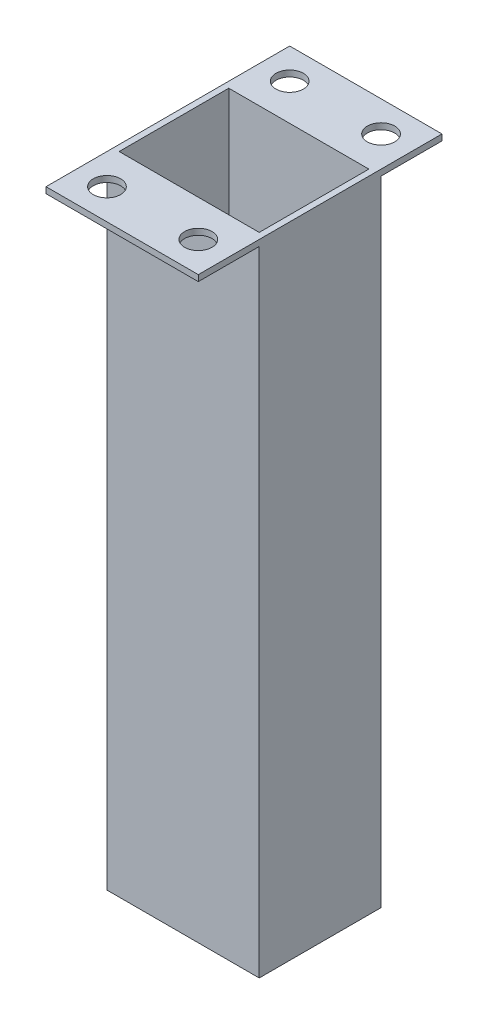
from build123d import *

# Parameters (mm, degrees)
SKETCH_1_W          = 25
SKETCH_1_H          = 105
EXTRUDE_1_DEPTH     = 40
SKETCH_2_OUTSIDE_W  = 65.022
SKETCH_2_OUTSIDE_H  = 130.022
CUT_EXTRUDE_1_DEPTH = 40
SKETCH_3_R          = 2.25
CUT_EXTRUDE_2_DEPTH = 40
SKETCH_4_R          = 2.25
SKETCH_4_W          = 23
SKETCH_4_H          = 18
CUT_EXTRUDE_3_DEPTH = 116.108644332


with BuildPart() as part:
    # Sketch 1 → Extrude 1 (new body)
    with BuildSketch(Plane.XY):
        with Locations((12.5, 52.5)):
            Rectangle(SKETCH_1_W, SKETCH_1_H)
    extrude(amount=EXTRUDE_1_DEPTH)

    # Sketch 2 outside → Cut-Extrude 1 (cut)
    with BuildSketch(Plane(origin=(25, 0, 0), x_dir=(0, 0, -1), z_dir=(1, 0, 0))):
        with Locations((-20, 52.5)):
            Rectangle(SKETCH_2_OUTSIDE_W, SKETCH_2_OUTSIDE_H)
        Polygon((-30, 0), (-30, 104), (-40, 104), (-40, 105), (0, 105), (0, 104), (-10, 104), (-10, 0), align=None, mode=Mode.SUBTRACT)
    extrude(amount=-CUT_EXTRUDE_1_DEPTH, mode=Mode.SUBTRACT)

    # Sketch 3 → Cut-Extrude 2 (cut)
    with BuildSketch(Plane(origin=(0, 105, 0), x_dir=(1, 0, 0), z_dir=(0, 1, 0))):
        with Locations(Location((5, -5, 0), (0, 0, 270))):
            Circle(SKETCH_3_R)
        with Locations(Location((20, -5, 0), (0, 0, 270))):
            Circle(SKETCH_3_R)
        with Locations(Location((5, -35, 0), (0, 0, 270))):
            Circle(SKETCH_3_R)
        with Locations(Location((20, -35, 0), (0, 0, 270))):
            Circle(SKETCH_3_R)
    extrude(amount=-CUT_EXTRUDE_2_DEPTH, mode=Mode.SUBTRACT)

    # Sketch 4 → Cut-Extrude 3 (cut, through all)
    with BuildSketch(Plane(origin=(0, 105, 0), x_dir=(1, 0, 0), z_dir=(0, 1, 0))):
        with Locations(Location((5, -5, 0), (0, 0, 270))):
            Circle(SKETCH_4_R)
        with Locations(Location((20, -5, 0), (0, 0, 270))):
            Circle(SKETCH_4_R)
        with Locations(Location((5, -35, 0), (0, 0, 270))):
            Circle(SKETCH_4_R)
        with Locations(Location((20, -35, 0), (0, 0, 270))):
            Circle(SKETCH_4_R)
        with Locations((12.5, -20)):
            Rectangle(SKETCH_4_W, SKETCH_4_H)
    extrude(amount=-CUT_EXTRUDE_3_DEPTH, mode=Mode.SUBTRACT)


solid = part.part
